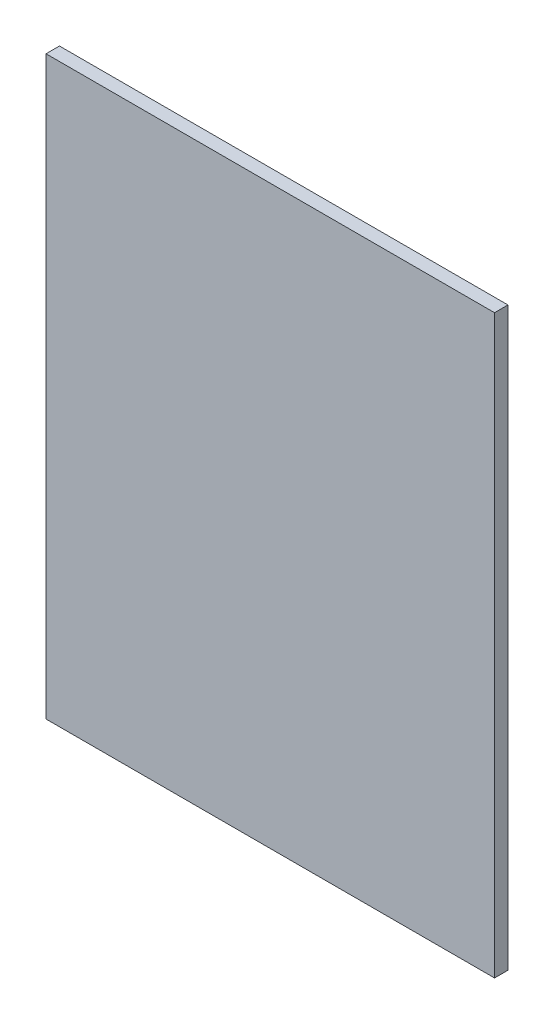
from build123d import *

# Parameters (mm, degrees)
SKETCH1_W            = 68.6
SKETCH1_H            = 1.6
PANEL_OR_BLOCK_DEPTH = 53.4


with BuildPart() as part:
    # Sketch1 → Panel_or_block (new body)
    with BuildSketch(Plane.YZ):
        with Locations((34.3, 0.8)):
            Rectangle(SKETCH1_W, SKETCH1_H)
    extrude(amount=PANEL_OR_BLOCK_DEPTH)


solid = part.part
